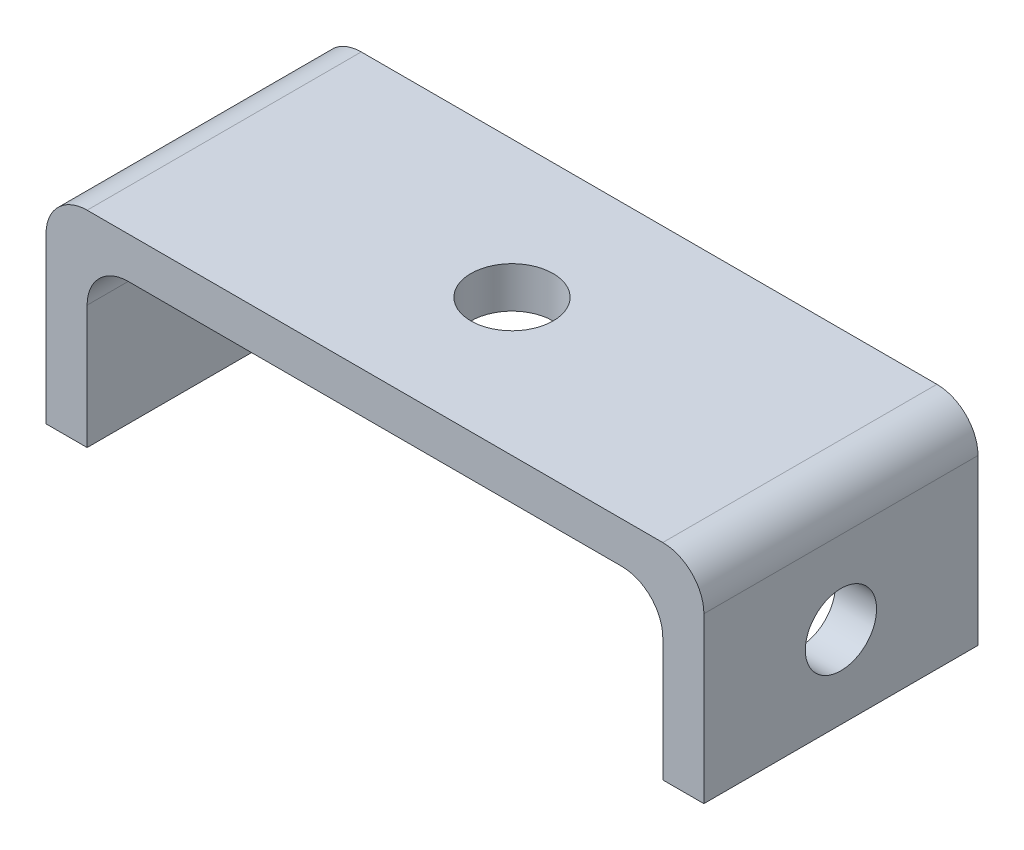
from build123d import *

# Parameters (mm, degrees)
EXTRUSION1_DEPTH        = 20
CONG_1_R                = 3
ESQUISSE2_R             = 2.6
ENL_V_MAT_EXTRU_1_DEPTH = 60.858316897
ESQUISSE3_R             = 3
ENL_V_MAT_EXTRU_2_DEPTH = 57.885788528


with BuildPart() as part:
    # Esquisse1 → Extrusion1 (new body)
    with BuildSketch(Plane.XY):
        Polygon((-51.884419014, 29.648239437), (-3.884419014, 29.648239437), (-3.884419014, 14.648239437), (-6.884419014, 14.648239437), (-6.884419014, 26.648239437), (-48.884419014, 26.648239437), (-48.884419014, 14.648239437), (-51.884419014, 14.648239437), align=None)
    extrude(amount=EXTRUSION1_DEPTH)

    # Cong_1
    cong_1_edges = [part.edges().sort_by_distance(p)[0] for p in [
        (-51.884419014, 29.648239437, 10),
        (-3.884419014, 29.648239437, 10),
        (-6.884419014, 26.648239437, 10),
        (-48.884419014, 26.648239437, 10),
    ]]
    fillet(cong_1_edges, radius=CONG_1_R)

    # Esquisse2 → Enl_v. mat.-Extru.1 (cut, through all)
    with BuildSketch(Plane.ZY.offset(51.884419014)):
        with Locations((10, 20.648239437)):
            Circle(ESQUISSE2_R)
    extrude(amount=-ENL_V_MAT_EXTRU_1_DEPTH, mode=Mode.SUBTRACT)

    # Esquisse3 → Enl_v. mat.-Extru.2 (cut, through all)
    with BuildSketch(Plane.XZ.offset(-26.648239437)):
        with Locations(Location((-27.884419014, 10, 0), (0, 0, 270))):
            Circle(ESQUISSE3_R)
    extrude(amount=-ENL_V_MAT_EXTRU_2_DEPTH, mode=Mode.SUBTRACT)


solid = part.part
